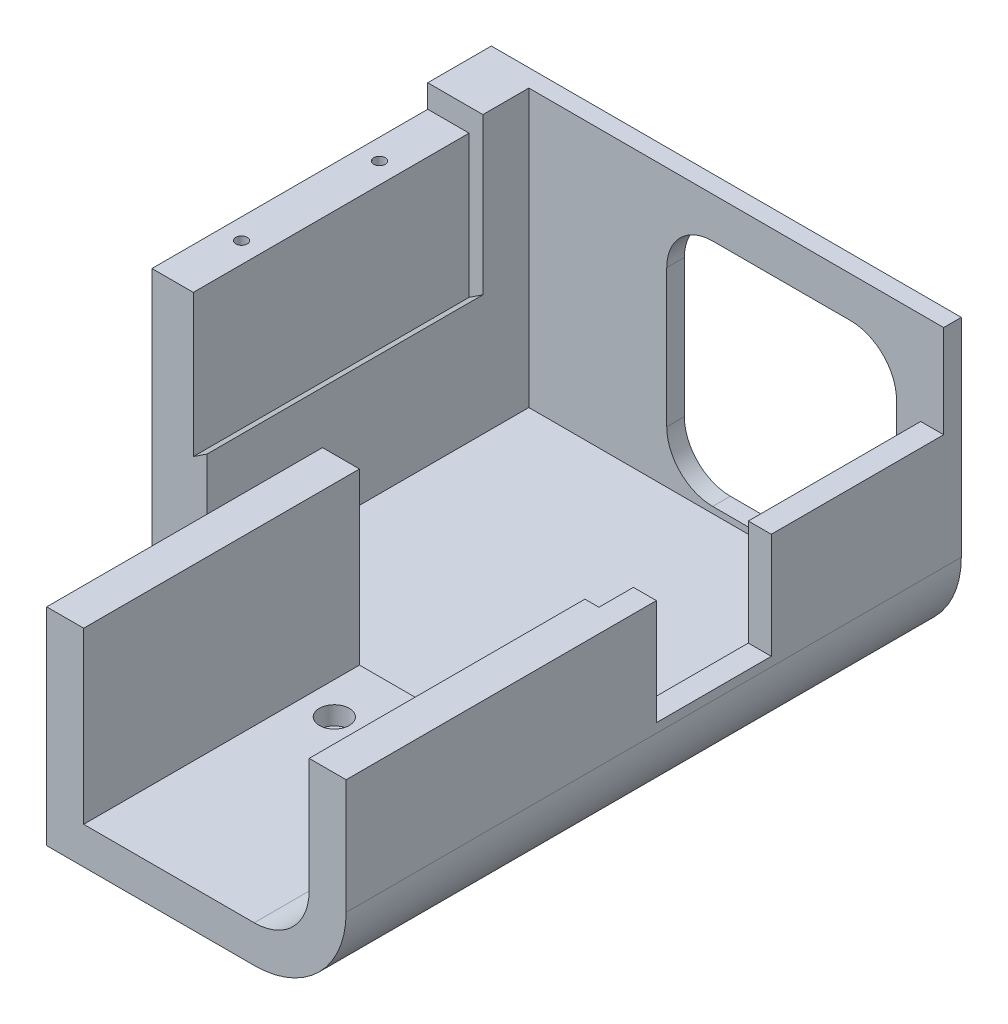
from build123d import *

# Parameters (mm, degrees)
BOSS_EXTRUDE1_DEPTH            = 70
BOSS_EXTRUDE2_DEPTH            = 60
CUT_EXTRUDE1_DEPTH             = 60
BOSS_EXTRUDE3_START            = -3.84
BOSS_EXTRUDE3_DEPTH            = 3.84
CBORE_FOR_M3_SHCS1_D           = 3.4
CBORE_FOR_M3_SHCS1_DEPTH       = 8.05
CBORE_FOR_M3_SHCS1_CBORE_D     = 6.5
CBORE_FOR_M3_SHCS1_CBORE_DEPTH = 4
CBORE_FOR_M3_SHCS1_TIP         = 1.021463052
SKETCH12_W                     = 25
SKETCH12_H                     = 23
CUT_EXTRUDE2_DEPTH             = 5
SKETCH13_W                     = 9
SKETCH13_H                     = 60
CUT_EXTRUDE3_DEPTH             = 5
M3X0_5_TAPPED_HOLE1_D          = 2.5
M3X0_5_TAPPED_HOLE1_DEPTH      = 8
M3X0_5_TAPPED_HOLE1_TIP        = 0.751075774


with BuildPart() as part:
    # Sketch3 → Boss-Extrude1 (new body)
    with BuildSketch(Plane.XY):
        with BuildLine():
            Line((85.25, 15), (85.25, 40))
            Line((85.25, 40), (90.25, 40))
            Line((90.25, 40), (90.25, 15))
            ThreePointArc((90.25, 15), (84.392135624, 0.857864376), (70.25, -5))
            Line((70.25, -5), (-12, -5))
            Line((-12, -5), (-12, 60.2))
            Line((-12, 60.2), (0, 60.2))
            Line((0, 60.2), (0, 0))
            Line((0, 0), (70.25, 0))
            ThreePointArc((70.25, 0), (80.856601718, 4.393398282), (85.25, 15))
        make_face()
    extrude(amount=BOSS_EXTRUDE1_DEPTH)

    # Sketch5 → Boss-Extrude2 (add)
    with BuildSketch(Plane.XY.offset(70)):
        with BuildLine():
            Line((82.2, 15), (82.2, 40))
            Line((82.2, 40), (90.25, 40))
            Line((90.25, 40), (90.25, 15))
            ThreePointArc((90.25, 15), (84.392135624, 0.857864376), (70.25, -5))
            Line((70.25, -5), (25.1, -5))
            Line((25.1, -5), (25.1, 40))
            Line((25.1, 40), (33.15, 40))
            Line((33.15, 40), (33.15, 3.05))
            Line((33.15, 3.05), (70.25, 3.05))
            ThreePointArc((70.25, 3.05), (78.699926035, 6.550073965), (82.2, 15))
        make_face()
    extrude(amount=BOSS_EXTRUDE2_DEPTH)

    # Sketch6 → Cut-Extrude1 (cut)
    with BuildSketch(Plane.XY.offset(70)):
        Polygon((-3, 24.26), (0, 26.24), (0, 60.2), (-3, 60.2), align=None)
    extrude(amount=-CUT_EXTRUDE1_DEPTH, mode=Mode.SUBTRACT)

    # Sketch7 → Boss-Extrude3 (add)
    with BuildSketch(Plane.XY.offset(BOSS_EXTRUDE3_START)):
        with BuildLine():
            Line((-12, 60.2), (-12, -5))
            Line((-12, -5), (70.25, -5))
            ThreePointArc((70.25, -5), (84.392135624, 0.857864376), (90.25, 15))
            Line((90.25, 15), (90.25, 60.2))
            Line((90.25, 60.2), (-12, 60.2))
        make_face()
        with BuildLine():
            Line((70, 51.37), (40, 51.37))
            ThreePointArc((40, 51.37), (32.928932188, 48.441067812), (30, 41.37))
            Line((30, 41.37), (30, 11.37))
            ThreePointArc((30, 11.37), (32.928932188, 4.298932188), (40, 1.37))
            Line((40, 1.37), (70, 1.37))
            ThreePointArc((70, 1.37), (77.071067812, 4.298932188), (80, 11.37))
            Line((80, 11.37), (80, 41.37))
            ThreePointArc((80, 41.37), (77.071067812, 48.441067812), (70, 51.37))
        make_face(mode=Mode.SUBTRACT)
    extrude(amount=BOSS_EXTRUDE3_DEPTH)

    # CBORE for M3 SHCS1
    with Locations(Plane(origin=(0, 3.05, 0), x_dir=(1, 0, 0), z_dir=(0, 1, 0))):
        with Locations((40.175, -82.5), (55.175, -82.5)):
            CounterBoreHole(CBORE_FOR_M3_SHCS1_D / 2, CBORE_FOR_M3_SHCS1_CBORE_D / 2, CBORE_FOR_M3_SHCS1_CBORE_DEPTH, depth=CBORE_FOR_M3_SHCS1_DEPTH)
            with Locations((0, 0, -(CBORE_FOR_M3_SHCS1_DEPTH + CBORE_FOR_M3_SHCS1_TIP / 2))):  # 118° drill point
                Cone(0, CBORE_FOR_M3_SHCS1_D / 2, CBORE_FOR_M3_SHCS1_TIP, mode=Mode.SUBTRACT)

    # Sketch12 → Cut-Extrude2 (cut)
    with BuildSketch(Plane(origin=(90.25, 0, 0), x_dir=(0, 0, -1), z_dir=(1, 0, 0))):
        with Locations((-50, 28.5)):
            Rectangle(SKETCH12_W, SKETCH12_H)
    extrude(amount=-CUT_EXTRUDE2_DEPTH, mode=Mode.SUBTRACT)

    # Sketch13 → Cut-Extrude3 (cut)
    with BuildSketch(Plane(origin=(0, 60.2, 0), x_dir=(1, 0, 0), z_dir=(0, 1, 0))):
        with Locations((-7.5, -40)):
            Rectangle(SKETCH13_W, SKETCH13_H)
    extrude(amount=-CUT_EXTRUDE3_DEPTH, mode=Mode.SUBTRACT)

    # M3x0.5 Tapped Hole1
    with Locations(Plane(origin=(0, 55.2, 0), x_dir=(1, 0, 0), z_dir=(0, 1, 0))):
        with Locations((-7.5, -25), (-7.5, -55)):
            Hole(M3X0_5_TAPPED_HOLE1_D / 2, depth=M3X0_5_TAPPED_HOLE1_DEPTH)
            with Locations((0, 0, -(M3X0_5_TAPPED_HOLE1_DEPTH + M3X0_5_TAPPED_HOLE1_TIP / 2))):  # 118° drill point
                Cone(0, M3X0_5_TAPPED_HOLE1_D / 2, M3X0_5_TAPPED_HOLE1_TIP, mode=Mode.SUBTRACT)


solid = part.part
